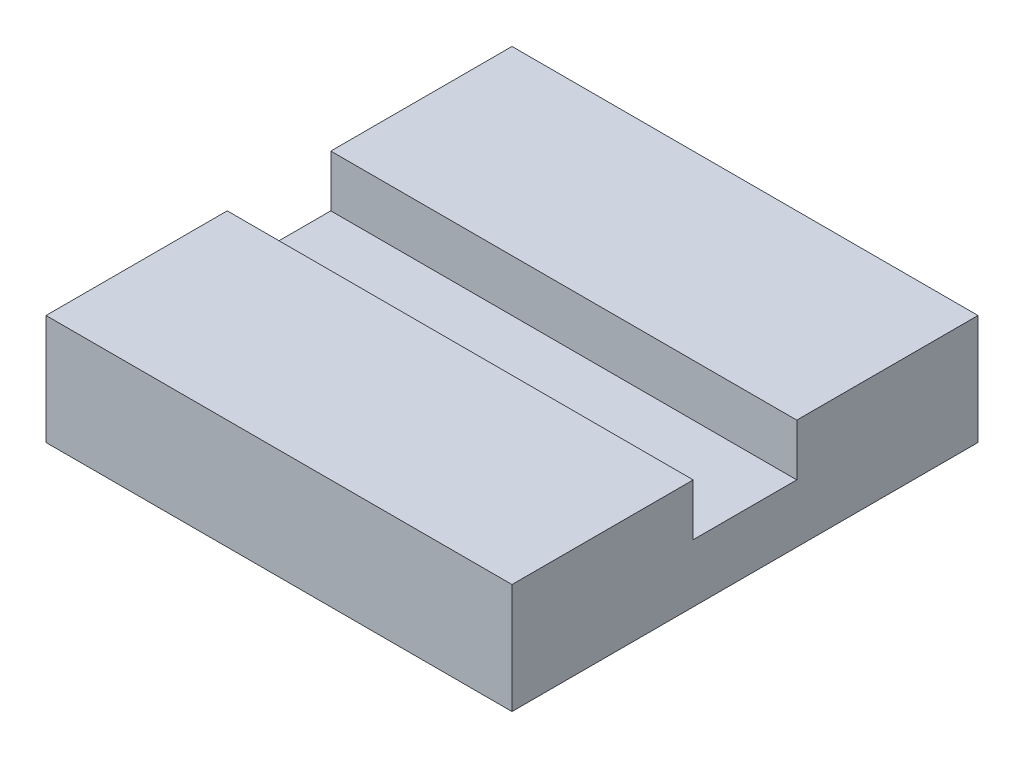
from build123d import *

# Parameters (mm, degrees)
SKETCH1_W           = 90
SKETCH1_H           = 90
BOSS_EXTRUDE1_DEPTH = 21.25
SKETCH3_R           = 10
BOSS_EXTRUDE2_DEPTH = 20
SKETCH4_W           = 20
SKETCH4_H           = 10
CUT_EXTRUDE2_DEPTH  = 103.84241586


with BuildPart() as part:
    # Sketch1 → Boss-Extrude1 (new body)
    with BuildSketch(Plane(origin=(0, 0, 0), x_dir=(1, 0, 0), z_dir=(0, 1, 0))):
        Rectangle(SKETCH1_W, SKETCH1_H)
    extrude(amount=BOSS_EXTRUDE1_DEPTH)

    # Sketch3 → Boss-Extrude2 (add)
    with BuildSketch(Plane.XZ):
        with Locations(Location((0, 0, 0), (0, 0, 270))):
            Circle(SKETCH3_R)
    extrude(amount=BOSS_EXTRUDE2_DEPTH)

    # Sketch4 → Cut-Extrude2 (cut, through all)
    with BuildSketch(Plane(origin=(45, 0, 0), x_dir=(0, 0, -1), z_dir=(1, 0, 0))):
        with Locations((0, 16.25)):
            Rectangle(SKETCH4_W, SKETCH4_H)
    extrude(amount=-CUT_EXTRUDE2_DEPTH, mode=Mode.SUBTRACT)


solid = part.part
